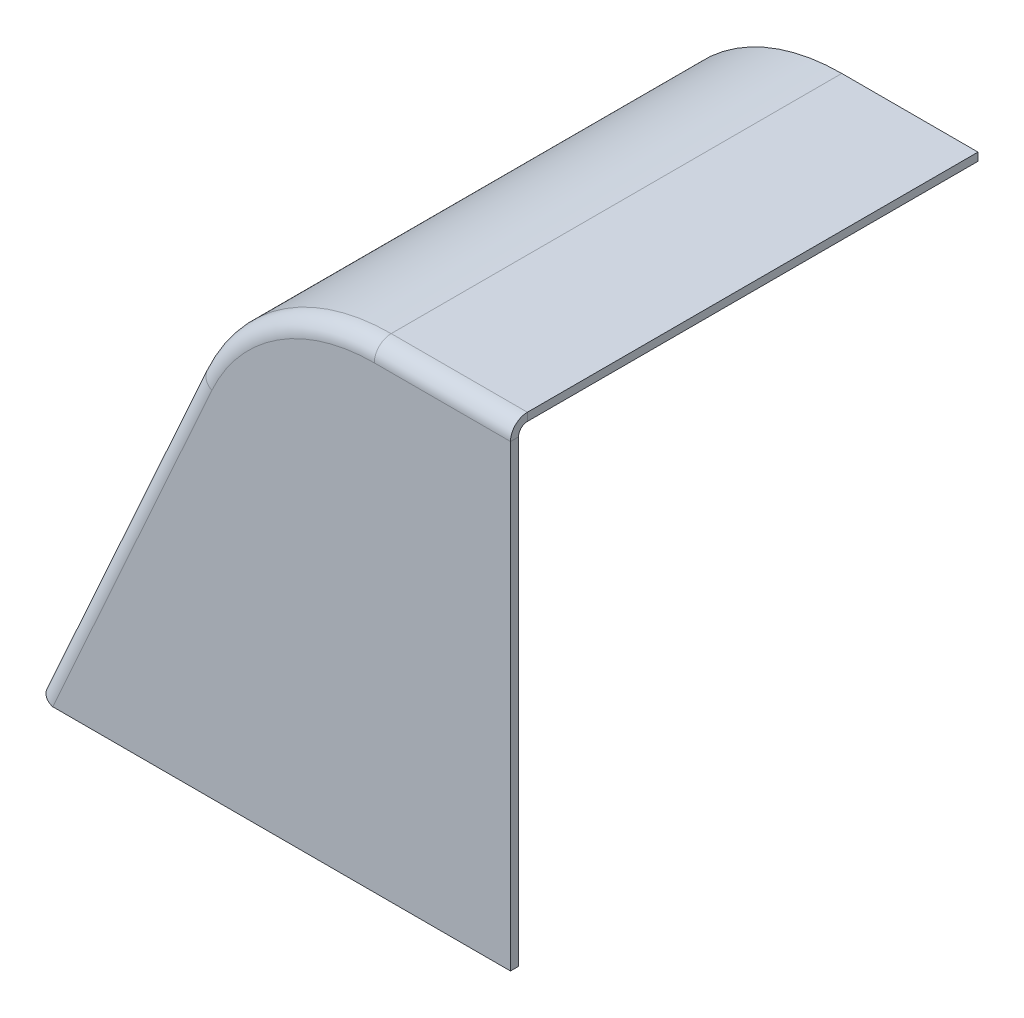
ISO-10303-21;
HEADER;
FILE_DESCRIPTION(('STEP AP214'),'2;1');
FILE_NAME('part.step','',(''),(''),'','','');
FILE_SCHEMA(('AUTOMOTIVE_DESIGN { 1 0 10303 214 1 1 1 1 }'));
ENDSEC;
DATA;
#1=APPLICATION_CONTEXT('core data for automotive mechanical design processes');
#2=APPLICATION_PROTOCOL_DEFINITION('international standard','automotive_design',2000,#1);
#3=PRODUCT_CONTEXT('',#1,'mechanical');
#4=PRODUCT('Part','Part','',(#3));
#5=PRODUCT_RELATED_PRODUCT_CATEGORY('part','',(#4));
#6=PRODUCT_DEFINITION_FORMATION('','',#4);
#7=PRODUCT_DEFINITION_CONTEXT('part definition',#1,'design');
#8=PRODUCT_DEFINITION('design','',#6,#7);
#9=PRODUCT_DEFINITION_SHAPE('','',#8);
#10=(LENGTH_UNIT() NAMED_UNIT(*) SI_UNIT(.MILLI.,.METRE.));
#11=(NAMED_UNIT(*) PLANE_ANGLE_UNIT() SI_UNIT($,.RADIAN.));
#12=(NAMED_UNIT(*) SI_UNIT($,.STERADIAN.) SOLID_ANGLE_UNIT());
#13=UNCERTAINTY_MEASURE_WITH_UNIT(LENGTH_MEASURE(1.E-05),#10,'distance_accuracy_value','');
#14=(GEOMETRIC_REPRESENTATION_CONTEXT(3) GLOBAL_UNCERTAINTY_ASSIGNED_CONTEXT((#13)) GLOBAL_UNIT_ASSIGNED_CONTEXT((#10,
#11,#12)) REPRESENTATION_CONTEXT('',''));
#15=CARTESIAN_POINT('',(0.,0.,0.));
#16=DIRECTION('',(0.,0.,1.));
#17=DIRECTION('',(1.,0.,0.));
#18=AXIS2_PLACEMENT_3D('',#15,#16,#17);
#19=CARTESIAN_POINT('',(0.,0.,-1.70942));
#20=DIRECTION('',(1.,0.,0.));
#21=DIRECTION('',(0.,0.,-1.));
#22=AXIS2_PLACEMENT_3D('',#19,#20,#21);
#23=PLANE('',#22);
#24=DIRECTION('',(0.,0.,1.));
#25=VECTOR('',#24,1.);
#26=CARTESIAN_POINT('',(0.,98.0950000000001,-1.70942));
#27=LINE('',#26,#25);
#28=CARTESIAN_POINT('',(0.,98.0950000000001,-1.70942));
#29=VERTEX_POINT('',#28);
#30=CARTESIAN_POINT('',(0.,98.0950000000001,0.));
#31=VERTEX_POINT('',#30);
#32=EDGE_CURVE('E498',#29,#31,#27,.T.);
#33=ORIENTED_EDGE('',*,*,#32,.T.);
#34=DIRECTION('',(0.,1.,0.));
#35=VECTOR('',#34,1.);
#36=CARTESIAN_POINT('',(0.,0.,0.));
#37=LINE('',#36,#35);
#38=CARTESIAN_POINT('',(0.,0.,0.));
#39=VERTEX_POINT('',#38);
#40=EDGE_CURVE('E513',#39,#31,#37,.T.);
#41=ORIENTED_EDGE('',*,*,#40,.F.);
#42=DIRECTION('',(0.,0.,1.));
#43=VECTOR('',#42,1.);
#44=CARTESIAN_POINT('',(0.,0.,-1.70942));
#45=LINE('',#44,#43);
#46=CARTESIAN_POINT('',(0.,0.,-1.70942));
#47=VERTEX_POINT('',#46);
#48=EDGE_CURVE('E13',#47,#39,#45,.T.);
#49=ORIENTED_EDGE('',*,*,#48,.F.);
#50=DIRECTION('',(0.,1.,0.));
#51=VECTOR('',#50,1.);
#52=CARTESIAN_POINT('',(0.,0.,-1.70942));
#53=LINE('',#52,#51);
#54=EDGE_CURVE('E225',#47,#29,#53,.T.);
#55=ORIENTED_EDGE('',*,*,#54,.T.);
#56=EDGE_LOOP('',(#33,#41,#49,#55));
#57=FACE_BOUND('',#56,.T.);
#58=ADVANCED_FACE('F214',(#57),#23,.T.);
#59=CARTESIAN_POINT('',(-29.1365756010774,60.,-1.70942));
#60=DIRECTION('',(0.,0.,-1.));
#61=DIRECTION('',(-1.,0.,0.));
#62=AXIS2_PLACEMENT_3D('',#59,#60,#61);
#63=PLANE('',#62);
#64=CARTESIAN_POINT('',(-29.1365756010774,60.,-1.70942));
#65=DIRECTION('',(0.,0.,1.));
#66=DIRECTION('',(0.,1.,0.));
#67=AXIS2_PLACEMENT_3D('',#64,#65,#66);
#68=CIRCLE('',#67,38.095);
#69=CARTESIAN_POINT('',(-29.1365756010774,98.095,-1.70942));
#70=VERTEX_POINT('',#69);
#71=CARTESIAN_POINT('',(-63.8762253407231,75.6328423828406,-1.70942));
#72=VERTEX_POINT('',#71);
#73=EDGE_CURVE('E233',#70,#72,#68,.T.);
#74=ORIENTED_EDGE('',*,*,#73,.F.);
#75=DIRECTION('',(-1.,0.,0.));
#76=VECTOR('',#75,1.);
#77=CARTESIAN_POINT('',(0.,98.0950000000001,-1.70942));
#78=LINE('',#77,#76);
#79=EDGE_CURVE('E537',#29,#70,#78,.T.);
#80=ORIENTED_EDGE('',*,*,#79,.F.);
#81=ORIENTED_EDGE('',*,*,#54,.F.);
#82=DIRECTION('',(1.,0.,0.));
#83=VECTOR('',#82,1.);
#84=CARTESIAN_POINT('',(-100.,0.,-1.70942));
#85=LINE('',#84,#83);
#86=CARTESIAN_POINT('',(-97.9110044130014,0.,-1.70942));
#87=VERTEX_POINT('',#86);
#88=EDGE_CURVE('E512',#87,#47,#85,.T.);
#89=ORIENTED_EDGE('',*,*,#88,.F.);
#90=DIRECTION('',(-0.410364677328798,-0.911921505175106,0.));
#91=VECTOR('',#90,1.);
#92=CARTESIAN_POINT('',(-63.8762253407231,75.6328423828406,-1.70942));
#93=LINE('',#92,#91);
#94=EDGE_CURVE('E238',#72,#87,#93,.T.);
#95=ORIENTED_EDGE('',*,*,#94,.F.);
#96=EDGE_LOOP('',(#74,#80,#81,#89,#95));
#97=FACE_BOUND('',#96,.T.);
#98=ADVANCED_FACE('F535',(#97),#63,.T.);
#99=CARTESIAN_POINT('',(-29.1365756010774,60.,0.));
#100=DIRECTION('',(0.,0.,-1.));
#101=DIRECTION('',(-1.,0.,0.));
#102=AXIS2_PLACEMENT_3D('',#99,#100,#101);
#103=PLANE('',#102);
#104=DIRECTION('',(-1.,0.,0.));
#105=VECTOR('',#104,1.);
#106=CARTESIAN_POINT('',(0.,98.0950000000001,0.));
#107=LINE('',#106,#105);
#108=CARTESIAN_POINT('',(-29.1365756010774,98.0950000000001,0.));
#109=VERTEX_POINT('',#108);
#110=EDGE_CURVE('E359',#31,#109,#107,.T.);
#111=ORIENTED_EDGE('',*,*,#110,.T.);
#112=CARTESIAN_POINT('',(-29.1365756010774,60.,0.));
#113=DIRECTION('',(0.,0.,1.));
#114=DIRECTION('',(1.,0.,0.));
#115=AXIS2_PLACEMENT_3D('',#112,#113,#114);
#116=CIRCLE('',#115,38.0950000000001);
#117=CARTESIAN_POINT('',(-63.8762253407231,75.6328423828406,0.));
#118=VERTEX_POINT('',#117);
#119=EDGE_CURVE('E350',#109,#118,#116,.T.);
#120=ORIENTED_EDGE('',*,*,#119,.T.);
#121=DIRECTION('',(-0.410364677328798,-0.911921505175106,0.));
#122=VECTOR('',#121,1.);
#123=CARTESIAN_POINT('',(-63.8762253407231,75.6328423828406,0.));
#124=LINE('',#123,#122);
#125=CARTESIAN_POINT('',(-97.9110044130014,0.,0.));
#126=VERTEX_POINT('',#125);
#127=EDGE_CURVE('E326',#118,#126,#124,.T.);
#128=ORIENTED_EDGE('',*,*,#127,.T.);
#129=DIRECTION('',(1.,0.,0.));
#130=VECTOR('',#129,1.);
#131=CARTESIAN_POINT('',(-100.,0.,0.));
#132=LINE('',#131,#130);
#133=EDGE_CURVE('E501',#126,#39,#132,.T.);
#134=ORIENTED_EDGE('',*,*,#133,.T.);
#135=ORIENTED_EDGE('',*,*,#40,.T.);
#136=EDGE_LOOP('',(#111,#120,#128,#134,#135));
#137=FACE_BOUND('',#136,.T.);
#138=ADVANCED_FACE('F594',(#137),#103,.F.);
#139=CARTESIAN_POINT('',(-100.,0.,-1.70942));
#140=DIRECTION('',(0.,-1.,0.));
#141=DIRECTION('',(0.,0.,-1.));
#142=AXIS2_PLACEMENT_3D('',#139,#140,#141);
#143=PLANE('',#142);
#144=CARTESIAN_POINT('',(-97.9110044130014,0.,-1.70942));
#145=CARTESIAN_POINT('',(-97.9110044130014,0.,0.));
#146=B_SPLINE_CURVE_WITH_KNOTS('',1,(#144,#145),.UNSPECIFIED.,.F.,.F.,(2,2),(0.,1.),.UNSPECIFIED.);
#147=EDGE_CURVE('E502',#87,#126,#146,.T.);
#148=ORIENTED_EDGE('',*,*,#147,.F.);
#149=ORIENTED_EDGE('',*,*,#88,.T.);
#150=ORIENTED_EDGE('',*,*,#48,.T.);
#151=ORIENTED_EDGE('',*,*,#133,.F.);
#152=EDGE_LOOP('',(#148,#149,#150,#151));
#153=FACE_BOUND('',#152,.T.);
#154=ADVANCED_FACE('F216',(#153),#143,.T.);
#155=CARTESIAN_POINT('',(0.,98.095,-3.61442));
#156=DIRECTION('',(-1.,0.,0.));
#157=DIRECTION('',(0.,-1.,0.));
#158=AXIS2_PLACEMENT_3D('',#155,#156,#157);
#159=PLANE('',#158);
#160=ORIENTED_EDGE('',*,*,#32,.F.);
#161=CARTESIAN_POINT('',(0.,98.095,-3.61442));
#162=DIRECTION('',(1.,0.,0.));
#163=DIRECTION('',(0.,1.,0.));
#164=AXIS2_PLACEMENT_3D('',#161,#162,#163);
#165=CIRCLE('',#164,1.905);
#166=CARTESIAN_POINT('',(0.,100.,-3.61442));
#167=VERTEX_POINT('',#166);
#168=EDGE_CURVE('E548',#29,#167,#165,.F.);
#169=ORIENTED_EDGE('',*,*,#168,.T.);
#170=DIRECTION('',(0.,1.,0.));
#171=VECTOR('',#170,1.);
#172=CARTESIAN_POINT('',(0.,100.,-3.61442));
#173=LINE('',#172,#171);
#174=CARTESIAN_POINT('',(0.,101.70942,-3.61442));
#175=VERTEX_POINT('',#174);
#176=EDGE_CURVE('E496',#167,#175,#173,.T.);
#177=ORIENTED_EDGE('',*,*,#176,.T.);
#178=CARTESIAN_POINT('',(0.,98.095,-3.61442));
#179=DIRECTION('',(-1.,0.,0.));
#180=DIRECTION('',(0.,0.,1.));
#181=AXIS2_PLACEMENT_3D('',#178,#179,#180);
#182=CIRCLE('',#181,3.61442);
#183=EDGE_CURVE('E550',#31,#175,#182,.T.);
#184=ORIENTED_EDGE('',*,*,#183,.F.);
#185=EDGE_LOOP('',(#160,#169,#177,#184));
#186=FACE_BOUND('',#185,.T.);
#187=ADVANCED_FACE('F547',(#186),#159,.F.);
#188=CARTESIAN_POINT('',(0.,100.,-1.70942));
#189=DIRECTION('',(1.,0.,0.));
#190=DIRECTION('',(0.,0.,-1.));
#191=AXIS2_PLACEMENT_3D('',#188,#189,#190);
#192=PLANE('',#191);
#193=ORIENTED_EDGE('',*,*,#176,.F.);
#194=DIRECTION('',(0.,0.,-1.));
#195=VECTOR('',#194,1.);
#196=CARTESIAN_POINT('',(0.,100.,-1.70942));
#197=LINE('',#196,#195);
#198=CARTESIAN_POINT('',(0.,100.,-100.));
#199=VERTEX_POINT('',#198);
#200=EDGE_CURVE('E542',#167,#199,#197,.T.);
#201=ORIENTED_EDGE('',*,*,#200,.T.);
#202=DIRECTION('',(0.,1.,0.));
#203=VECTOR('',#202,1.);
#204=CARTESIAN_POINT('',(0.,100.,-100.));
#205=LINE('',#204,#203);
#206=CARTESIAN_POINT('',(0.,101.70942,-100.));
#207=VERTEX_POINT('',#206);
#208=EDGE_CURVE('E494',#199,#207,#205,.T.);
#209=ORIENTED_EDGE('',*,*,#208,.T.);
#210=DIRECTION('',(0.,0.,1.));
#211=VECTOR('',#210,1.);
#212=CARTESIAN_POINT('',(0.,101.70942,-1.70942));
#213=LINE('',#212,#211);
#214=EDGE_CURVE('E591',#175,#207,#213,.F.);
#215=ORIENTED_EDGE('',*,*,#214,.F.);
#216=EDGE_LOOP('',(#193,#201,#209,#215));
#217=FACE_BOUND('',#216,.T.);
#218=ADVANCED_FACE('F616',(#217),#192,.T.);
#219=CARTESIAN_POINT('',(0.,100.,-100.));
#220=DIRECTION('',(0.,0.,-1.));
#221=DIRECTION('',(-1.,0.,0.));
#222=AXIS2_PLACEMENT_3D('',#219,#220,#221);
#223=PLANE('',#222);
#224=ORIENTED_EDGE('',*,*,#208,.F.);
#225=DIRECTION('',(-1.,0.,0.));
#226=VECTOR('',#225,1.);
#227=CARTESIAN_POINT('',(0.,100.,-100.));
#228=LINE('',#227,#226);
#229=CARTESIAN_POINT('',(-29.1365756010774,100.,-100.));
#230=VERTEX_POINT('',#229);
#231=EDGE_CURVE('E569',#199,#230,#228,.T.);
#232=ORIENTED_EDGE('',*,*,#231,.T.);
#233=DIRECTION('',(0.,1.,0.));
#234=VECTOR('',#233,1.);
#235=CARTESIAN_POINT('',(-29.1365756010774,100.,-100.));
#236=LINE('',#235,#234);
#237=CARTESIAN_POINT('',(-29.1365756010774,101.70942,-100.));
#238=VERTEX_POINT('',#237);
#239=EDGE_CURVE('E492',#230,#238,#236,.T.);
#240=ORIENTED_EDGE('',*,*,#239,.T.);
#241=DIRECTION('',(1.,0.,0.));
#242=VECTOR('',#241,1.);
#243=CARTESIAN_POINT('',(0.,101.70942,-100.));
#244=LINE('',#243,#242);
#245=EDGE_CURVE('E352',#207,#238,#244,.F.);
#246=ORIENTED_EDGE('',*,*,#245,.F.);
#247=EDGE_LOOP('',(#224,#232,#240,#246));
#248=FACE_BOUND('',#247,.T.);
#249=ADVANCED_FACE('F617',(#248),#223,.T.);
#250=CARTESIAN_POINT('',(-29.1365756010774,60.,-100.));
#251=DIRECTION('',(0.,0.,-1.));
#252=DIRECTION('',(-1.,0.,0.));
#253=AXIS2_PLACEMENT_3D('',#250,#251,#252);
#254=PLANE('',#253);
#255=ORIENTED_EDGE('',*,*,#239,.F.);
#256=CARTESIAN_POINT('',(-29.1365756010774,60.,-100.));
#257=DIRECTION('',(0.,0.,1.));
#258=DIRECTION('',(0.,1.,0.));
#259=AXIS2_PLACEMENT_3D('',#256,#257,#258);
#260=CIRCLE('',#259,40.);
#261=CARTESIAN_POINT('',(-65.6134358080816,76.4145870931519,-100.));
#262=VERTEX_POINT('',#261);
#263=EDGE_CURVE('E437',#230,#262,#260,.T.);
#264=ORIENTED_EDGE('',*,*,#263,.T.);
#265=DIRECTION('',(-0.911921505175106,0.410364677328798,0.));
#266=VECTOR('',#265,1.);
#267=CARTESIAN_POINT('',(-65.6134358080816,76.4145870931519,-100.));
#268=LINE('',#267,#266);
#269=CARTESIAN_POINT('',(-67.1722926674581,77.1160726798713,-100.));
#270=VERTEX_POINT('',#269);
#271=EDGE_CURVE('E489',#262,#270,#268,.T.);
#272=ORIENTED_EDGE('',*,*,#271,.T.);
#273=CARTESIAN_POINT('',(-29.1365756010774,60.,-100.));
#274=DIRECTION('',(0.,0.,1.));
#275=DIRECTION('',(1.,0.,0.));
#276=AXIS2_PLACEMENT_3D('',#273,#274,#275);
#277=CIRCLE('',#276,41.70942);
#278=EDGE_CURVE('E336',#238,#270,#277,.T.);
#279=ORIENTED_EDGE('',*,*,#278,.F.);
#280=EDGE_LOOP('',(#255,#264,#272,#279));
#281=FACE_BOUND('',#280,.T.);
#282=ADVANCED_FACE('F600',(#281),#254,.T.);
#283=CARTESIAN_POINT('',(-65.6134358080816,76.4145870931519,-100.));
#284=DIRECTION('',(0.,0.,-1.));
#285=DIRECTION('',(-0.410364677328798,-0.911921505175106,0.));
#286=AXIS2_PLACEMENT_3D('',#283,#284,#285);
#287=PLANE('',#286);
#288=ORIENTED_EDGE('',*,*,#271,.F.);
#289=DIRECTION('',(-0.410364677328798,-0.911921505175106,0.));
#290=VECTOR('',#289,1.);
#291=CARTESIAN_POINT('',(-65.6134358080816,76.4145870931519,-100.));
#292=LINE('',#291,#290);
#293=CARTESIAN_POINT('',(-100.,0.,-100.));
#294=VERTEX_POINT('',#293);
#295=EDGE_CURVE('E433',#262,#294,#292,.T.);
#296=ORIENTED_EDGE('',*,*,#295,.T.);
#297=DIRECTION('',(-0.911921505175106,0.410364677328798,0.));
#298=VECTOR('',#297,1.);
#299=CARTESIAN_POINT('',(-100.,0.,-100.));
#300=LINE('',#299,#298);
#301=CARTESIAN_POINT('',(-101.558856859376,0.701485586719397,-100.));
#302=VERTEX_POINT('',#301);
#303=EDGE_CURVE('E482',#294,#302,#300,.T.);
#304=ORIENTED_EDGE('',*,*,#303,.T.);
#305=DIRECTION('',(-0.410364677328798,-0.911921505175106,0.));
#306=VECTOR('',#305,1.);
#307=CARTESIAN_POINT('',(-67.1722926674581,77.1160726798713,-100.));
#308=LINE('',#307,#306);
#309=EDGE_CURVE('E366',#270,#302,#308,.T.);
#310=ORIENTED_EDGE('',*,*,#309,.F.);
#311=EDGE_LOOP('',(#288,#296,#304,#310));
#312=FACE_BOUND('',#311,.T.);
#313=ADVANCED_FACE('F603',(#312),#287,.T.);
#314=CARTESIAN_POINT('',(-100.,0.,-1.70942));
#315=DIRECTION('',(0.410364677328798,0.911921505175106,0.));
#316=DIRECTION('',(0.,0.,-1.));
#317=AXIS2_PLACEMENT_3D('',#314,#315,#316);
#318=PLANE('',#317);
#319=ORIENTED_EDGE('',*,*,#303,.F.);
#320=DIRECTION('',(0.,0.,-1.));
#321=VECTOR('',#320,1.);
#322=CARTESIAN_POINT('',(-100.,0.,-1.70942));
#323=LINE('',#322,#321);
#324=CARTESIAN_POINT('',(-100.,0.,-3.61442));
#325=VERTEX_POINT('',#324);
#326=EDGE_CURVE('E428',#325,#294,#323,.T.);
#327=ORIENTED_EDGE('',*,*,#326,.F.);
#328=CARTESIAN_POINT('',(-101.558856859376,0.701485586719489,-3.61442));
#329=CARTESIAN_POINT('',(-100.,0.,-3.61442));
#330=B_SPLINE_CURVE_WITH_KNOTS('',1,(#328,#329),.UNSPECIFIED.,.F.,.F.,(2,2),(0.,1.),.UNSPECIFIED.);
#331=CARTESIAN_POINT('',(-101.558856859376,0.701485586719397,-3.61442));
#332=VERTEX_POINT('',#331);
#333=EDGE_CURVE('E490',#325,#332,#330,.F.);
#334=ORIENTED_EDGE('',*,*,#333,.T.);
#335=DIRECTION('',(0.,0.,1.));
#336=VECTOR('',#335,1.);
#337=CARTESIAN_POINT('',(-101.558856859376,0.701485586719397,-1.70942));
#338=LINE('',#337,#336);
#339=EDGE_CURVE('E321',#332,#302,#338,.F.);
#340=ORIENTED_EDGE('',*,*,#339,.T.);
#341=EDGE_LOOP('',(#319,#327,#334,#340));
#342=FACE_BOUND('',#341,.T.);
#343=ADVANCED_FACE('F461',(#342),#318,.F.);
#344=CARTESIAN_POINT('',(-101.558856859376,0.701485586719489,-3.61442));
#345=CARTESIAN_POINT('',(-101.546862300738,0.728140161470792,-3.41036892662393));
#346=CARTESIAN_POINT('',(-101.517806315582,0.750702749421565,-3.18750892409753));
#347=CARTESIAN_POINT('',(-101.435374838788,0.772361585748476,-2.83258333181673));
#348=CARTESIAN_POINT('',(-101.401409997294,0.777549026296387,-2.71086416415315));
#349=CARTESIAN_POINT('',(-101.339057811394,0.781528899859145,-2.52464746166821));
#350=CARTESIAN_POINT('',(-101.316373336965,0.782222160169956,-2.46197345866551));
#351=CARTESIAN_POINT('',(-101.279294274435,0.782221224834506,-2.36728749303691));
#352=CARTESIAN_POINT('',(-101.266425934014,0.782047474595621,-2.33561331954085));
#353=CARTESIAN_POINT('',(-101.246336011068,0.781515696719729,-2.28796506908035));
#354=CARTESIAN_POINT('',(-101.239508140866,0.781293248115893,-2.27205950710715));
#355=CARTESIAN_POINT('',(-101.229066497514,0.780890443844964,-2.24817103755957));
#356=CARTESIAN_POINT('',(-101.225552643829,0.780744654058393,-2.24020319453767));
#357=CARTESIAN_POINT('',(-101.220231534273,0.780508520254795,-2.22824442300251));
#358=CARTESIAN_POINT('',(-101.218449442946,0.780426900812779,-2.22425699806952));
#359=CARTESIAN_POINT('',(-101.215763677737,0.780300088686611,-2.21827417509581));
#360=CARTESIAN_POINT('',(-101.214866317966,0.780257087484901,-2.21627961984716));
#361=CARTESIAN_POINT('',(-101.213067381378,0.780169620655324,-2.21228995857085));
#362=CARTESIAN_POINT('',(-101.211746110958,0.780104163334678,-2.20936815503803));
#363=CARTESIAN_POINT('',(-101.14931068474,0.776981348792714,-2.0715086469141));
#364=CARTESIAN_POINT('',(-101.062471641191,0.769877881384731,-1.89887646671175));
#365=CARTESIAN_POINT('',(-100.808831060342,0.734076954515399,-1.50446334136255));
#366=CARTESIAN_POINT('',(-100.641576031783,0.705181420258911,-1.28230674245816));
#367=CARTESIAN_POINT('',(-100.193561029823,0.610678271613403,-0.834971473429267));
#368=CARTESIAN_POINT('',(-99.9736621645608,0.558084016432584,-0.670621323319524));
#369=CARTESIAN_POINT('',(-99.6819227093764,0.485554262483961,-0.486123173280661));
#370=CARTESIAN_POINT('',(-99.5908110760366,0.46234046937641,-0.434913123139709));
#371=CARTESIAN_POINT('',(-99.4656861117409,0.430017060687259,-0.370226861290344));
#372=CARTESIAN_POINT('',(-99.4258917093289,0.419654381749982,-0.35068928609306));
#373=CARTESIAN_POINT('',(-99.3692848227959,0.4048242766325,-0.324043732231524));
#374=CARTESIAN_POINT('',(-99.3509294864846,0.399999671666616,-0.315605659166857));
#375=CARTESIAN_POINT('',(-99.3241894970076,0.392951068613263,-0.303570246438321));
#376=CARTESIAN_POINT('',(-99.3154083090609,0.390632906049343,-0.299662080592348));
#377=CARTESIAN_POINT('',(-99.3024373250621,0.387203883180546,-0.293949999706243));
#378=CARTESIAN_POINT('',(-99.2981471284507,0.386068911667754,-0.292071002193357));
#379=CARTESIAN_POINT('',(-99.2917623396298,0.384378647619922,-0.289289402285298));
#380=CARTESIAN_POINT('',(-99.2896424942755,0.383817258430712,-0.28836835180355));
#381=CARTESIAN_POINT('',(-99.286475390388,0.382978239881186,-0.286995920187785));
#382=CARTESIAN_POINT('',(-99.2854217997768,0.382699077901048,-0.286539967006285));
#383=CARTESIAN_POINT('',(-99.2833188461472,0.382141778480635,-0.285631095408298));
#384=CARTESIAN_POINT('',(-99.2831770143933,0.382104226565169,-0.285569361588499));
#385=CARTESIAN_POINT('',(-98.7807992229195,0.248924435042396,-0.0690231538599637));
#386=CARTESIAN_POINT('',(-98.305323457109,0.113634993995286,0.));
#387=CARTESIAN_POINT('',(-97.9110044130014,0.,0.));
#388=CARTESIAN_POINT('',(-100.,0.,-3.61442));
#389=CARTESIAN_POINT('',(-99.9880051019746,0.0266553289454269,-3.50687071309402));
#390=CARTESIAN_POINT('',(-99.9663839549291,0.0525626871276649,-3.3894141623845));
#391=CARTESIAN_POINT('',(-99.9125395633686,0.0870857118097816,-3.20234867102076));
#392=CARTESIAN_POINT('',(-99.8910150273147,0.0978712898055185,-3.13819591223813));
#393=CARTESIAN_POINT('',(-99.8524816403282,0.112569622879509,-3.04004937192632));
#394=CARTESIAN_POINT('',(-99.8385962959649,0.117222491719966,-3.00701669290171));
#395=CARTESIAN_POINT('',(-99.8161006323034,0.123784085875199,-2.95711193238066));
#396=CARTESIAN_POINT('',(-99.8083241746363,0.125901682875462,-2.94041788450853));
#397=CARTESIAN_POINT('',(-99.7962297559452,0.128967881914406,-2.91530461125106));
#398=CARTESIAN_POINT('',(-99.7921266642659,0.129971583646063,-2.90692149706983));
#399=CARTESIAN_POINT('',(-99.7858630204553,0.131448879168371,-2.89433094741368));
#400=CARTESIAN_POINT('',(-99.7837569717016,0.131936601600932,-2.89013145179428));
#401=CARTESIAN_POINT('',(-99.7805704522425,0.132661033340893,-2.88382851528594));
#402=CARTESIAN_POINT('',(-99.7795037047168,0.13290131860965,-2.88172692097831));
#403=CARTESIAN_POINT('',(-99.7778966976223,0.133259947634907,-2.87857364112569));
#404=CARTESIAN_POINT('',(-99.7773598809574,0.133379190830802,-2.8775223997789));
#405=CARTESIAN_POINT('',(-99.776283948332,0.13361707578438,-2.87541962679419));
#406=CARTESIAN_POINT('',(-99.7754939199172,0.133790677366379,-2.87387967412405));
#407=CARTESIAN_POINT('',(-99.7381671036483,0.141966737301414,-2.80122005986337));
#408=CARTESIAN_POINT('',(-99.6867391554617,0.150798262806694,-2.71023331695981));
#409=CARTESIAN_POINT('',(-99.5391919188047,0.162739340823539,-2.50235570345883));
#410=CARTESIAN_POINT('',(-99.4428325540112,0.165746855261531,-2.38526684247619));
#411=CARTESIAN_POINT('',(-99.1877479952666,0.158062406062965,-2.14949632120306));
#412=CARTESIAN_POINT('',(-99.0636439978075,0.148575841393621,-2.06287466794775));
#413=CARTESIAN_POINT('',(-98.8994826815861,0.133456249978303,-1.96563390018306));
#414=CARTESIAN_POINT('',(-98.8483138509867,0.128216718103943,-1.93864336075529));
#415=CARTESIAN_POINT('',(-98.7781214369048,0.120612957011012,-1.90455010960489));
#416=CARTESIAN_POINT('',(-98.7558122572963,0.118118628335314,-1.89425272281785));
#417=CARTESIAN_POINT('',(-98.724093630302,0.114488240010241,-1.88020903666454));
#418=CARTESIAN_POINT('',(-98.7138113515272,0.11329651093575,-1.87576170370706));
#419=CARTESIAN_POINT('',(-98.6988357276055,0.111541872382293,-1.86941837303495));
#420=CARTESIAN_POINT('',(-98.6939184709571,0.11096247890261,-1.86735855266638));
#421=CARTESIAN_POINT('',(-98.6866558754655,0.110102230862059,-1.86434796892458));
#422=CARTESIAN_POINT('',(-98.6842538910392,0.109816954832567,-1.8633576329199));
#423=CARTESIAN_POINT('',(-98.6806793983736,0.109391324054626,-1.86189157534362));
#424=CARTESIAN_POINT('',(-98.6794926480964,0.109249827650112,-1.86140613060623));
#425=CARTESIAN_POINT('',(-98.6777196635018,0.109038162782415,-1.8606827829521));
#426=CARTESIAN_POINT('',(-98.6771298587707,0.108967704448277,-1.86044247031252));
#427=CARTESIAN_POINT('',(-98.6759526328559,0.108826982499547,-1.859963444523));
#428=CARTESIAN_POINT('',(-98.6758732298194,0.108817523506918,-1.85993090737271));
#429=CARTESIAN_POINT('',(-98.3946520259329,0.0751581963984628,-1.74579903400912));
#430=CARTESIAN_POINT('',(-98.1301831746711,0.0348051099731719,-1.70942));
#431=CARTESIAN_POINT('',(-97.9110044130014,0.,-1.70942));
#432=B_SPLINE_SURFACE_WITH_KNOTS('',1,3,((#344,#345,#346,#347,#348,#349,#350,#351,#352,#353,
#354,#355,#356,#357,#358,#359,#360,#361,#362,#363,#364,#365,#366,#367,#368,#369,#370,#371,#372,
#373,#374,#375,#376,#377,#378,#379,#380,#381,#382,#383,#384,#385,#386,#387),(#388,#389,#390,
#391,#392,#393,#394,#395,#396,#397,#398,#399,#400,#401,#402,#403,#404,#405,#406,#407,#408,#409,
#410,#411,#412,#413,#414,#415,#416,#417,#418,#419,#420,#421,#422,#423,#424,#425,#426,#427,#428,
#429,#430,#431)),.UNSPECIFIED.,.F.,.F.,.F.,(2,2),(4,2,2,2,2,2,2,2,2,2,2,2,2,2,2,2,2,2,2,2,2,4),
(0.,1.),(0.,0.125,0.1875,0.21875,0.234375,0.2421875,0.24609375,0.248046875,0.2490234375,0.25,
0.375,0.5,0.625,0.6875,0.71875,0.734375,0.7421875,0.74609375,0.748046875,0.7490234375,0.75,1.),.UNSPECIFIED.);
#433=CARTESIAN_POINT('',(-100.,0.,-3.61442));
#434=CARTESIAN_POINT('',(-99.996931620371,0.00681947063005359,-3.58690656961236));
#435=CARTESIAN_POINT('',(-99.9933038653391,0.0134278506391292,-3.55940323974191));
#436=CARTESIAN_POINT('',(-99.9847514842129,0.0265015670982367,-3.50324478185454));
#437=CARTESIAN_POINT('',(-99.9797763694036,0.0329474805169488,-3.4745928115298));
#438=CARTESIAN_POINT('',(-99.9683858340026,0.0456315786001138,-3.4162038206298));
#439=CARTESIAN_POINT('',(-99.9619181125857,0.0518492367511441,-3.38647253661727));
#440=CARTESIAN_POINT('',(-99.9473967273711,0.0640116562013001,-3.32600706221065));
#441=CARTESIAN_POINT('',(-99.9392890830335,0.0699349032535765,-3.29528149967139));
#442=CARTESIAN_POINT('',(-99.9213409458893,0.0814426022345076,-3.23292632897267));
#443=CARTESIAN_POINT('',(-99.9114449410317,0.087004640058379,-3.20130855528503));
#444=CARTESIAN_POINT('',(-99.8897734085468,0.0977240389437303,-3.13728555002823));
#445=CARTESIAN_POINT('',(-99.8779410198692,0.102858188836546,-3.10489566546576));
#446=CARTESIAN_POINT('',(-99.8522521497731,0.112657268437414,-3.03946492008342));
#447=CARTESIAN_POINT('',(-99.8383376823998,0.11729832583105,-3.0064432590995));
#448=CARTESIAN_POINT('',(-99.808343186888,0.126046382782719,-2.93990239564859));
#449=CARTESIAN_POINT('',(-99.7922042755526,0.130128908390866,-2.90640643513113));
#450=CARTESIAN_POINT('',(-99.7652890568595,0.136026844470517,-2.85401584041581));
#451=CARTESIAN_POINT('',(-99.7550806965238,0.138078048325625,-2.83485336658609));
#452=CARTESIAN_POINT('',(-99.7326987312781,0.142193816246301,-2.79430699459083));
#453=CARTESIAN_POINT('',(-99.7204437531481,0.14422428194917,-2.77296440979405));
#454=CARTESIAN_POINT('',(-99.6937364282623,0.148193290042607,-2.72821474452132));
#455=CARTESIAN_POINT('',(-99.6791946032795,0.150093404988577,-2.70485764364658));
#456=CARTESIAN_POINT('',(-99.6476626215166,0.153689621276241,-2.65627282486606));
#457=CARTESIAN_POINT('',(-99.63057545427,0.155343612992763,-2.63110489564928));
#458=CARTESIAN_POINT('',(-99.5936885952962,0.158328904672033,-2.57913547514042));
#459=CARTESIAN_POINT('',(-99.5737852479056,0.15961483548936,-2.55240488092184));
#460=CARTESIAN_POINT('',(-99.5309947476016,0.161741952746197,-2.49759642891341));
#461=CARTESIAN_POINT('',(-99.5079984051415,0.162535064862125,-2.46960195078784));
#462=CARTESIAN_POINT('',(-99.4587473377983,0.163554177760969,-2.41260369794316));
#463=CARTESIAN_POINT('',(-99.4323789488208,0.163730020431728,-2.38369691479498));
#464=CARTESIAN_POINT('',(-99.3909389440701,0.163483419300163,-2.34066254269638));
#465=CARTESIAN_POINT('',(-99.3764137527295,0.163304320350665,-2.32600286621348));
#466=CARTESIAN_POINT('',(-99.3464366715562,0.162754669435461,-2.2966013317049));
#467=CARTESIAN_POINT('',(-99.3309701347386,0.162377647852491,-2.28187449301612));
#468=CARTESIAN_POINT('',(-99.2996120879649,0.161431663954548,-2.25289021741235));
#469=CARTESIAN_POINT('',(-99.2837206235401,0.160862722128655,-2.23863273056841));
#470=CARTESIAN_POINT('',(-99.2520696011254,0.159558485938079,-2.21107311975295));
#471=CARTESIAN_POINT('',(-99.2363236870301,0.158829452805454,-2.19775499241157));
#472=CARTESIAN_POINT('',(-99.1901976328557,0.156472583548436,-2.15986666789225));
#473=CARTESIAN_POINT('',(-99.159333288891,0.154624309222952,-2.13589453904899));
#474=CARTESIAN_POINT('',(-99.0986845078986,0.150512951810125,-2.09140188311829));
#475=CARTESIAN_POINT('',(-99.068988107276,0.148290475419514,-2.07075718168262));
#476=CARTESIAN_POINT('',(-99.011007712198,0.143581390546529,-2.03260907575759));
#477=CARTESIAN_POINT('',(-98.9827993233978,0.141129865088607,-2.01498642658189));
#478=CARTESIAN_POINT('',(-98.9280788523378,0.136090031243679,-1.98257280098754));
#479=CARTESIAN_POINT('',(-98.9016309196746,0.133531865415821,-1.96766872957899));
#480=CARTESIAN_POINT('',(-98.8506678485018,0.128384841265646,-1.94038798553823));
#481=CARTESIAN_POINT('',(-98.826206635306,0.125821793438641,-1.92790560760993));
#482=CARTESIAN_POINT('',(-98.7794115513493,0.120752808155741,-1.90517675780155));
#483=CARTESIAN_POINT('',(-98.757122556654,0.118268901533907,-1.89483295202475));
#484=CARTESIAN_POINT('',(-98.7148316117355,0.113427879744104,-1.8761081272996));
#485=CARTESIAN_POINT('',(-98.694866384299,0.111089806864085,-1.86763893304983));
#486=CARTESIAN_POINT('',(-98.6403485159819,0.104567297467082,-1.84551381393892));
#487=CARTESIAN_POINT('',(-98.6055591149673,0.100256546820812,-1.83247235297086));
#488=CARTESIAN_POINT('',(-98.5365575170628,0.0914504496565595,-1.80871050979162));
#489=CARTESIAN_POINT('',(-98.5023657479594,0.0869663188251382,-1.79792641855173));
#490=CARTESIAN_POINT('',(-98.4347072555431,0.0778784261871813,-1.77852166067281));
#491=CARTESIAN_POINT('',(-98.4012572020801,0.0732843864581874,-1.76983834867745));
#492=CARTESIAN_POINT('',(-98.3352135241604,0.0640359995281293,-1.75447431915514));
#493=CARTESIAN_POINT('',(-98.3026330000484,0.0593899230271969,-1.74773225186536));
#494=CARTESIAN_POINT('',(-98.2384411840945,0.0500879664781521,-1.73608689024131));
#495=CARTESIAN_POINT('',(-98.2068397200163,0.0454390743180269,-1.73112380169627));
#496=CARTESIAN_POINT('',(-98.1447020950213,0.0361745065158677,-1.72287193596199));
#497=CARTESIAN_POINT('',(-98.11417276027,0.0315646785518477,-1.7195251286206));
#498=CARTESIAN_POINT('',(-98.0542596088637,0.0224142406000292,-1.71434247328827));
#499=CARTESIAN_POINT('',(-98.0248798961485,0.0178784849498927,-1.71245053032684));
#500=CARTESIAN_POINT('',(-97.9673318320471,0.00890510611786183,-1.71001611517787));
#501=CARTESIAN_POINT('',(-97.93916512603,0.00447151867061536,-1.70941965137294));
#502=CARTESIAN_POINT('',(-97.9110044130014,0.,-1.70942));
#503=B_SPLINE_CURVE_WITH_KNOTS('',3,(#433,#434,#435,#436,#437,#438,#439,#440,#441,#442,#443,
#444,#445,#446,#447,#448,#449,#450,#451,#452,#453,#454,#455,#456,#457,#458,#459,#460,#461,#462,
#463,#464,#465,#466,#467,#468,#469,#470,#471,#472,#473,#474,#475,#476,#477,#478,#479,#480,#481,
#482,#483,#484,#485,#486,#487,#488,#489,#490,#491,#492,#493,#494,#495,#496,#497,#498,#499,#500,
#501,#502),.UNSPECIFIED.,.F.,.F.,(4,2,2,2,2,2,2,2,2,2,2,2,2,2,2,2,2,2,2,2,2,2,2,2,2,2,2,2,2,2,2,
2,2,2,4),(0.,0.085528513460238,0.174859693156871,0.267993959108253,0.364931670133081,
0.465673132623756,0.570218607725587,0.678568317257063,0.790722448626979,0.85613915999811,
0.930205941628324,1.01292250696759,1.10428852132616,1.20430360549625,1.31296733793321,
1.43027925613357,1.49218505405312,1.55625345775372,1.62031502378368,1.68221489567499,
1.79951769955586,1.90817596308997,2.00818922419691,2.09955706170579,2.1822790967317,
2.25635499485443,2.32178446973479,2.43393275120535,2.54227828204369,2.64682124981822,
2.74756187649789,2.84450042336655,2.93763719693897,3.0269725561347,3.11250692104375),.UNSPECIFIED.);
#504=EDGE_CURVE('E219',#325,#87,#503,.T.);
#505=CARTESIAN_POINT('',(-101.558856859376,0.70148558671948,-3.61442));
#506=CARTESIAN_POINT('',(-101.555789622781,0.708303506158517,-3.56223099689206));
#507=CARTESIAN_POINT('',(-101.551674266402,0.714692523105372,-3.51004750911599));
#508=CARTESIAN_POINT('',(-101.541130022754,0.726869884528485,-3.40349630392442));
#509=CARTESIAN_POINT('',(-101.53460737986,0.732619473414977,-3.34913341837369));
#510=CARTESIAN_POINT('',(-101.518976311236,0.743395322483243,-3.23835009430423));
#511=CARTESIAN_POINT('',(-101.509770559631,0.748380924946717,-3.18193941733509));
#512=CARTESIAN_POINT('',(-101.488497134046,0.757504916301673,-3.06721631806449));
#513=CARTESIAN_POINT('',(-101.476328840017,0.761600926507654,-3.00891916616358));
#514=CARTESIAN_POINT('',(-101.448851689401,0.768820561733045,-2.89061066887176));
#515=CARTESIAN_POINT('',(-101.433439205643,0.771900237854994,-2.8306206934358));
#516=CARTESIAN_POINT('',(-101.399195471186,0.776962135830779,-2.70914776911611));
#517=CARTESIAN_POINT('',(-101.380257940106,0.778899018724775,-2.64769286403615));
#518=CARTESIAN_POINT('',(-101.338689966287,0.781552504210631,-2.52354891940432));
#519=CARTESIAN_POINT('',(-101.315951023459,0.782222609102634,-2.46089523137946));
#520=CARTESIAN_POINT('',(-101.266511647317,0.782220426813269,-2.33464526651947));
#521=CARTESIAN_POINT('',(-101.239700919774,0.781500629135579,-2.27109202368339));
#522=CARTESIAN_POINT('',(-101.194678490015,0.779251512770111,-2.17168302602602));
#523=CARTESIAN_POINT('',(-101.177541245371,0.778184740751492,-2.13532524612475));
#524=CARTESIAN_POINT('',(-101.13983952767,0.775406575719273,-2.05839550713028));
#525=CARTESIAN_POINT('',(-101.119121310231,0.773628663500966,-2.01790102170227));
#526=CARTESIAN_POINT('',(-101.073817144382,0.769229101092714,-1.93299593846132));
#527=CARTESIAN_POINT('',(-101.049061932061,0.76653322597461,-1.88867948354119));
#528=CARTESIAN_POINT('',(-100.9952075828,0.760084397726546,-1.79649780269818));
#529=CARTESIAN_POINT('',(-100.965924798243,0.756250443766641,-1.7487453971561));
#530=CARTESIAN_POINT('',(-100.902514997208,0.747300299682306,-1.65014256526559));
#531=CARTESIAN_POINT('',(-100.868191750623,0.74209713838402,-1.59942622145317));
#532=CARTESIAN_POINT('',(-100.794182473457,0.730176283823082,-1.49543425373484));
#533=CARTESIAN_POINT('',(-100.754289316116,0.723366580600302,-1.44231606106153));
#534=CARTESIAN_POINT('',(-100.69127516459,0.712063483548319,-1.36276188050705));
#535=CARTESIAN_POINT('',(-100.669086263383,0.707986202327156,-1.33552199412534));
#536=CARTESIAN_POINT('',(-100.62314864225,0.699354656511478,-1.28067843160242));
#537=CARTESIAN_POINT('',(-100.599372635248,0.694788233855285,-1.25309946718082));
#538=CARTESIAN_POINT('',(-100.550199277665,0.685150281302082,-1.19767891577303));
#539=CARTESIAN_POINT('',(-100.524774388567,0.680066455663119,-1.1698639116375));
#540=CARTESIAN_POINT('',(-100.472242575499,0.6693673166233,-1.11407871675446));
#541=CARTESIAN_POINT('',(-100.445107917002,0.663739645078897,-1.08613700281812));
#542=CARTESIAN_POINT('',(-100.390032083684,0.652120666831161,-1.0311441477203));
#543=CARTESIAN_POINT('',(-100.362090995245,0.646129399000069,-1.0040929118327));
#544=CARTESIAN_POINT('',(-100.306382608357,0.633999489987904,-0.951802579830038));
#545=CARTESIAN_POINT('',(-100.278641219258,0.627872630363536,-0.926533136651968));
#546=CARTESIAN_POINT('',(-100.223433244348,0.615517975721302,-0.877739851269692));
#547=CARTESIAN_POINT('',(-100.195990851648,0.60930116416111,-0.854185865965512));
#548=CARTESIAN_POINT('',(-100.141476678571,0.596809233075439,-0.808755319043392));
#549=CARTESIAN_POINT('',(-100.114427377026,0.590544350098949,-0.786848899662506));
#550=CARTESIAN_POINT('',(-100.035503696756,0.572080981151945,-0.724749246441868));
#551=CARTESIAN_POINT('',(-99.9828975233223,0.559549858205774,-0.685576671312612));
#552=CARTESIAN_POINT('',(-99.8800674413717,0.534658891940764,-0.613195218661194));
#553=CARTESIAN_POINT('',(-99.8299865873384,0.52236461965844,-0.579759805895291));
#554=CARTESIAN_POINT('',(-99.7327405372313,0.498188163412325,-0.518260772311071));
#555=CARTESIAN_POINT('',(-99.6856970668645,0.486362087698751,-0.489982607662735));
#556=CARTESIAN_POINT('',(-99.5949757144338,0.463323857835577,-0.438221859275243));
#557=CARTESIAN_POINT('',(-99.5514000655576,0.452159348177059,-0.414538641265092));
#558=CARTESIAN_POINT('',(-99.4679831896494,0.430610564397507,-0.371414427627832));
#559=CARTESIAN_POINT('',(-99.428227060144,0.420266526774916,-0.351788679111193));
#560=CARTESIAN_POINT('',(-99.3527522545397,0.400492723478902,-0.316261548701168));
#561=CARTESIAN_POINT('',(-99.3171032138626,0.39109695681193,-0.30019271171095));
#562=CARTESIAN_POINT('',(-99.2197061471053,0.365280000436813,-0.25821120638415));
#563=CARTESIAN_POINT('',(-99.1575083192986,0.348635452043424,-0.233467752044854));
#564=CARTESIAN_POINT('',(-99.0340592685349,0.315327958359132,-0.18838371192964));
#565=CARTESIAN_POINT('',(-98.9728464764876,0.298684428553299,-0.167923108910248));
#566=CARTESIAN_POINT('',(-98.8516479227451,0.265503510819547,-0.13110580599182));
#567=CARTESIAN_POINT('',(-98.7916935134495,0.248982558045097,-0.114631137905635));
#568=CARTESIAN_POINT('',(-98.6732609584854,0.216159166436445,-0.0854804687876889));
#569=CARTESIAN_POINT('',(-98.6148074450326,0.199870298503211,-0.0726889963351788));
#570=CARTESIAN_POINT('',(-98.4995906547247,0.167607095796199,-0.0505938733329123));
#571=CARTESIAN_POINT('',(-98.4428458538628,0.151643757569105,-0.041177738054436));
#572=CARTESIAN_POINT('',(-98.3312287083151,0.120113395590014,-0.0255212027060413));
#573=CARTESIAN_POINT('',(-98.2763691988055,0.104555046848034,-0.0191717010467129));
#574=CARTESIAN_POINT('',(-98.1686747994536,0.0739030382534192,-0.00933849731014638));
#575=CARTESIAN_POINT('',(-98.1158476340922,0.0588159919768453,-0.00574940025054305));
#576=CARTESIAN_POINT('',(-98.0123427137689,0.0291620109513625,-0.00113045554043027));
#577=CARTESIAN_POINT('',(-97.9616680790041,0.0145999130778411,7.54513142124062E-07));
#578=CARTESIAN_POINT('',(-97.9110044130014,0.,0.));
#579=B_SPLINE_CURVE_WITH_KNOTS('',3,(#505,#506,#507,#508,#509,#510,#511,#512,#513,#514,#515,
#516,#517,#518,#519,#520,#521,#522,#523,#524,#525,#526,#527,#528,#529,#530,#531,#532,#533,#534,
#535,#536,#537,#538,#539,#540,#541,#542,#543,#544,#545,#546,#547,#548,#549,#550,#551,#552,#553,
#554,#555,#556,#557,#558,#559,#560,#561,#562,#563,#564,#565,#566,#567,#568,#569,#570,#571,#572,
#573,#574,#575,#576,#577,#578),.UNSPECIFIED.,.F.,.F.,(4,2,2,2,2,2,2,2,2,2,2,2,2,2,2,2,2,2,2,2,2,
2,2,2,2,2,2,2,2,2,2,2,2,2,2,2,4),(0.,0.158153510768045,0.323259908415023,0.495319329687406,
0.674331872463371,0.860297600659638,1.05321654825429,1.25308872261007,1.45991410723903,
1.58052096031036,1.7170534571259,1.86951098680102,2.03789285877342,2.22219830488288,
2.42242648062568,2.5285221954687,2.6385995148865,2.75265840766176,2.87069884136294,
2.98872667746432,3.10277465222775,3.2128427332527,3.31893088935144,3.51914898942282,
3.70345107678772,3.87183630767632,4.02430391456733,4.16085320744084,4.28148357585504,
4.4882981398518,4.68816258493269,4.88107689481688,5.06704107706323,5.2460551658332,
5.41811922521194,5.58323335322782,5.74139768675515),.UNSPECIFIED.);
#580=EDGE_CURVE('E443',#332,#126,#579,.T.);
#581=ORIENTED_EDGE('',*,*,#333,.F.);
#582=ORIENTED_EDGE('',*,*,#504,.T.);
#583=ORIENTED_EDGE('',*,*,#147,.T.);
#584=ORIENTED_EDGE('',*,*,#580,.F.);
#585=EDGE_LOOP('',(#581,#582,#583,#584));
#586=FACE_BOUND('',#585,.T.);
#587=ADVANCED_FACE('F378',(#586),#432,.T.);
#588=CARTESIAN_POINT('',(-63.8762253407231,75.6328423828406,-3.61442));
#589=DIRECTION('',(-0.410364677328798,-0.911921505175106,0.));
#590=DIRECTION('',(0.911921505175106,-0.410364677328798,0.));
#591=AXIS2_PLACEMENT_3D('',#588,#589,#590);
#592=CYLINDRICAL_SURFACE('',#591,3.61442);
#593=DIRECTION('',(-0.410364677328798,-0.911921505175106,0.));
#594=VECTOR('',#593,1.);
#595=CARTESIAN_POINT('',(-67.1722926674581,77.1160726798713,-3.61442));
#596=LINE('',#595,#594);
#597=CARTESIAN_POINT('',(-67.1722926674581,77.1160726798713,-3.61442));
#598=VERTEX_POINT('',#597);
#599=EDGE_CURVE('E315',#598,#332,#596,.T.);
#600=ORIENTED_EDGE('',*,*,#599,.T.);
#601=ORIENTED_EDGE('',*,*,#580,.T.);
#602=ORIENTED_EDGE('',*,*,#127,.F.);
#603=CARTESIAN_POINT('',(-63.8762253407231,75.6328423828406,-3.61442));
#604=DIRECTION('',(-0.410364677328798,-0.911921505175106,0.));
#605=DIRECTION('',(0.911921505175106,-0.410364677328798,0.));
#606=AXIS2_PLACEMENT_3D('',#603,#604,#605);
#607=CIRCLE('',#606,3.61442);
#608=EDGE_CURVE('E344',#118,#598,#607,.T.);
#609=ORIENTED_EDGE('',*,*,#608,.T.);
#610=EDGE_LOOP('',(#600,#601,#602,#609));
#611=FACE_BOUND('',#610,.T.);
#612=ADVANCED_FACE('F349',(#611),#592,.T.);
#613=CARTESIAN_POINT('',(-67.1722926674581,77.1160726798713,-1.70942));
#614=DIRECTION('',(-0.911921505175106,0.410364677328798,0.));
#615=DIRECTION('',(-0.410364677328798,-0.911921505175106,0.));
#616=AXIS2_PLACEMENT_3D('',#613,#614,#615);
#617=PLANE('',#616);
#618=ORIENTED_EDGE('',*,*,#309,.T.);
#619=ORIENTED_EDGE('',*,*,#339,.F.);
#620=ORIENTED_EDGE('',*,*,#599,.F.);
#621=DIRECTION('',(0.,0.,1.));
#622=VECTOR('',#621,1.);
#623=CARTESIAN_POINT('',(-67.1722926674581,77.1160726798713,-1.70942));
#624=LINE('',#623,#622);
#625=EDGE_CURVE('E319',#598,#270,#624,.F.);
#626=ORIENTED_EDGE('',*,*,#625,.T.);
#627=EDGE_LOOP('',(#618,#619,#620,#626));
#628=FACE_BOUND('',#627,.T.);
#629=ADVANCED_FACE('F318',(#628),#617,.T.);
#630=CARTESIAN_POINT('',(-29.1365756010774,60.,-1.70942));
#631=DIRECTION('',(0.,0.,1.));
#632=DIRECTION('',(1.,0.,0.));
#633=AXIS2_PLACEMENT_3D('',#630,#631,#632);
#634=CYLINDRICAL_SURFACE('',#633,41.70942);
#635=ORIENTED_EDGE('',*,*,#278,.T.);
#636=ORIENTED_EDGE('',*,*,#625,.F.);
#637=CARTESIAN_POINT('',(-29.1365756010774,60.,-3.61442));
#638=DIRECTION('',(0.,0.,1.));
#639=DIRECTION('',(1.,0.,0.));
#640=AXIS2_PLACEMENT_3D('',#637,#638,#639);
#641=CIRCLE('',#640,41.70942);
#642=CARTESIAN_POINT('',(-29.1365756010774,101.70942,-3.61442));
#643=VERTEX_POINT('',#642);
#644=EDGE_CURVE('E333',#643,#598,#641,.T.);
#645=ORIENTED_EDGE('',*,*,#644,.F.);
#646=DIRECTION('',(0.,0.,1.));
#647=VECTOR('',#646,1.);
#648=CARTESIAN_POINT('',(-29.1365756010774,101.70942,-1.70942));
#649=LINE('',#648,#647);
#650=EDGE_CURVE('E355',#643,#238,#649,.F.);
#651=ORIENTED_EDGE('',*,*,#650,.T.);
#652=EDGE_LOOP('',(#635,#636,#645,#651));
#653=FACE_BOUND('',#652,.T.);
#654=ADVANCED_FACE('F331',(#653),#634,.T.);
#655=CARTESIAN_POINT('',(-29.1365756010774,60.,-3.61442));
#656=DIRECTION('',(0.,0.,1.));
#657=DIRECTION('',(1.,0.,0.));
#658=AXIS2_PLACEMENT_3D('',#655,#656,#657);
#659=TOROIDAL_SURFACE('',#658,38.095,3.61442);
#660=ORIENTED_EDGE('',*,*,#644,.T.);
#661=ORIENTED_EDGE('',*,*,#608,.F.);
#662=ORIENTED_EDGE('',*,*,#119,.F.);
#663=CARTESIAN_POINT('',(-29.1365756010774,98.095,-3.61442));
#664=DIRECTION('',(1.,0.,0.));
#665=DIRECTION('',(0.,1.,0.));
#666=AXIS2_PLACEMENT_3D('',#663,#664,#665);
#667=CIRCLE('',#666,3.61442);
#668=EDGE_CURVE('E346',#109,#643,#667,.F.);
#669=ORIENTED_EDGE('',*,*,#668,.T.);
#670=EDGE_LOOP('',(#660,#661,#662,#669));
#671=FACE_BOUND('',#670,.T.);
#672=ADVANCED_FACE('F342',(#671),#659,.T.);
#673=CARTESIAN_POINT('',(0.,101.70942,-1.70942));
#674=DIRECTION('',(0.,1.,0.));
#675=DIRECTION('',(0.,0.,1.));
#676=AXIS2_PLACEMENT_3D('',#673,#674,#675);
#677=PLANE('',#676);
#678=ORIENTED_EDGE('',*,*,#245,.T.);
#679=ORIENTED_EDGE('',*,*,#650,.F.);
#680=DIRECTION('',(-1.,0.,0.));
#681=VECTOR('',#680,1.);
#682=CARTESIAN_POINT('',(0.,101.70942,-3.61442));
#683=LINE('',#682,#681);
#684=EDGE_CURVE('E357',#175,#643,#683,.T.);
#685=ORIENTED_EDGE('',*,*,#684,.F.);
#686=ORIENTED_EDGE('',*,*,#214,.T.);
#687=EDGE_LOOP('',(#678,#679,#685,#686));
#688=FACE_BOUND('',#687,.T.);
#689=ADVANCED_FACE('F385',(#688),#677,.T.);
#690=CARTESIAN_POINT('',(0.,98.095,-3.61442));
#691=DIRECTION('',(-1.,0.,0.));
#692=DIRECTION('',(0.,0.,1.));
#693=AXIS2_PLACEMENT_3D('',#690,#691,#692);
#694=CYLINDRICAL_SURFACE('',#693,3.61442);
#695=ORIENTED_EDGE('',*,*,#684,.T.);
#696=ORIENTED_EDGE('',*,*,#668,.F.);
#697=ORIENTED_EDGE('',*,*,#110,.F.);
#698=ORIENTED_EDGE('',*,*,#183,.T.);
#699=EDGE_LOOP('',(#695,#696,#697,#698));
#700=FACE_BOUND('',#699,.T.);
#701=ADVANCED_FACE('F388',(#700),#694,.T.);
#702=CARTESIAN_POINT('',(-63.8762253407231,75.6328423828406,-3.61442));
#703=DIRECTION('',(-0.410364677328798,-0.911921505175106,0.));
#704=DIRECTION('',(0.911921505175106,-0.410364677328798,0.));
#705=AXIS2_PLACEMENT_3D('',#702,#703,#704);
#706=CYLINDRICAL_SURFACE('',#705,1.905);
#707=DIRECTION('',(-0.410364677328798,-0.911921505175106,0.));
#708=VECTOR('',#707,1.);
#709=CARTESIAN_POINT('',(-65.6134358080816,76.4145870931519,-3.61442));
#710=LINE('',#709,#708);
#711=CARTESIAN_POINT('',(-65.6134358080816,76.4145870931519,-3.61442));
#712=VERTEX_POINT('',#711);
#713=EDGE_CURVE('E420',#712,#325,#710,.T.);
#714=ORIENTED_EDGE('',*,*,#713,.F.);
#715=CARTESIAN_POINT('',(-63.8762253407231,75.6328423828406,-3.61442));
#716=DIRECTION('',(0.410364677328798,0.911921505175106,0.));
#717=DIRECTION('',(-0.911921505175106,0.410364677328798,0.));
#718=AXIS2_PLACEMENT_3D('',#715,#716,#717);
#719=CIRCLE('',#718,1.905);
#720=EDGE_CURVE('E563',#72,#712,#719,.F.);
#721=ORIENTED_EDGE('',*,*,#720,.F.);
#722=ORIENTED_EDGE('',*,*,#94,.T.);
#723=ORIENTED_EDGE('',*,*,#504,.F.);
#724=EDGE_LOOP('',(#714,#721,#722,#723));
#725=FACE_BOUND('',#724,.T.);
#726=ADVANCED_FACE('F392',(#725),#706,.F.);
#727=CARTESIAN_POINT('',(-65.6134358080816,76.4145870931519,-1.70942));
#728=DIRECTION('',(-0.911921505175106,0.410364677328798,0.));
#729=DIRECTION('',(-0.410364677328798,-0.911921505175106,0.));
#730=AXIS2_PLACEMENT_3D('',#727,#728,#729);
#731=PLANE('',#730);
#732=ORIENTED_EDGE('',*,*,#295,.F.);
#733=DIRECTION('',(0.,0.,-1.));
#734=VECTOR('',#733,1.);
#735=CARTESIAN_POINT('',(-65.6134358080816,76.4145870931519,-1.70942));
#736=LINE('',#735,#734);
#737=EDGE_CURVE('E568',#712,#262,#736,.T.);
#738=ORIENTED_EDGE('',*,*,#737,.F.);
#739=ORIENTED_EDGE('',*,*,#713,.T.);
#740=ORIENTED_EDGE('',*,*,#326,.T.);
#741=EDGE_LOOP('',(#732,#738,#739,#740));
#742=FACE_BOUND('',#741,.T.);
#743=ADVANCED_FACE('F407',(#742),#731,.F.);
#744=CARTESIAN_POINT('',(-29.1365756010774,60.,-1.70942));
#745=DIRECTION('',(0.,0.,1.));
#746=DIRECTION('',(1.,0.,0.));
#747=AXIS2_PLACEMENT_3D('',#744,#745,#746);
#748=CYLINDRICAL_SURFACE('',#747,40.);
#749=ORIENTED_EDGE('',*,*,#263,.F.);
#750=DIRECTION('',(0.,0.,-1.));
#751=VECTOR('',#750,1.);
#752=CARTESIAN_POINT('',(-29.1365756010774,100.,-1.70942));
#753=LINE('',#752,#751);
#754=CARTESIAN_POINT('',(-29.1365756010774,100.,-3.61442));
#755=VERTEX_POINT('',#754);
#756=EDGE_CURVE('E561',#755,#230,#753,.T.);
#757=ORIENTED_EDGE('',*,*,#756,.F.);
#758=CARTESIAN_POINT('',(-29.1365756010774,60.,-3.61442));
#759=DIRECTION('',(0.,0.,1.));
#760=DIRECTION('',(0.,1.,0.));
#761=AXIS2_PLACEMENT_3D('',#758,#759,#760);
#762=CIRCLE('',#761,40.);
#763=EDGE_CURVE('E566',#755,#712,#762,.T.);
#764=ORIENTED_EDGE('',*,*,#763,.T.);
#765=ORIENTED_EDGE('',*,*,#737,.T.);
#766=EDGE_LOOP('',(#749,#757,#764,#765));
#767=FACE_BOUND('',#766,.T.);
#768=ADVANCED_FACE('F402',(#767),#748,.F.);
#769=CARTESIAN_POINT('',(-29.1365756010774,60.,-3.61442));
#770=DIRECTION('',(0.,0.,1.));
#771=DIRECTION('',(1.,0.,0.));
#772=AXIS2_PLACEMENT_3D('',#769,#770,#771);
#773=TOROIDAL_SURFACE('',#772,38.095,1.905);
#774=ORIENTED_EDGE('',*,*,#763,.F.);
#775=CARTESIAN_POINT('',(-29.1365756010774,98.095,-3.61442));
#776=DIRECTION('',(1.,0.,0.));
#777=DIRECTION('',(0.,1.,0.));
#778=AXIS2_PLACEMENT_3D('',#775,#776,#777);
#779=CIRCLE('',#778,1.905);
#780=EDGE_CURVE('E541',#70,#755,#779,.F.);
#781=ORIENTED_EDGE('',*,*,#780,.F.);
#782=ORIENTED_EDGE('',*,*,#73,.T.);
#783=ORIENTED_EDGE('',*,*,#720,.T.);
#784=EDGE_LOOP('',(#774,#781,#782,#783));
#785=FACE_BOUND('',#784,.T.);
#786=ADVANCED_FACE('F399',(#785),#773,.F.);
#787=CARTESIAN_POINT('',(0.,100.,-1.70942));
#788=DIRECTION('',(0.,1.,0.));
#789=DIRECTION('',(0.,0.,1.));
#790=AXIS2_PLACEMENT_3D('',#787,#788,#789);
#791=PLANE('',#790);
#792=ORIENTED_EDGE('',*,*,#231,.F.);
#793=ORIENTED_EDGE('',*,*,#200,.F.);
#794=DIRECTION('',(-1.,0.,0.));
#795=VECTOR('',#794,1.);
#796=CARTESIAN_POINT('',(0.,100.,-3.61442));
#797=LINE('',#796,#795);
#798=EDGE_CURVE('E553',#167,#755,#797,.T.);
#799=ORIENTED_EDGE('',*,*,#798,.T.);
#800=ORIENTED_EDGE('',*,*,#756,.T.);
#801=EDGE_LOOP('',(#792,#793,#799,#800));
#802=FACE_BOUND('',#801,.T.);
#803=ADVANCED_FACE('F397',(#802),#791,.F.);
#804=CARTESIAN_POINT('',(0.,98.095,-3.61442));
#805=DIRECTION('',(-1.,0.,0.));
#806=DIRECTION('',(0.,0.,1.));
#807=AXIS2_PLACEMENT_3D('',#804,#805,#806);
#808=CYLINDRICAL_SURFACE('',#807,1.905);
#809=ORIENTED_EDGE('',*,*,#798,.F.);
#810=ORIENTED_EDGE('',*,*,#168,.F.);
#811=ORIENTED_EDGE('',*,*,#79,.T.);
#812=ORIENTED_EDGE('',*,*,#780,.T.);
#813=EDGE_LOOP('',(#809,#810,#811,#812));
#814=FACE_BOUND('',#813,.T.);
#815=ADVANCED_FACE('F394',(#814),#808,.F.);
#816=CLOSED_SHELL('',(#58,#98,#138,#154,#187,#218,#249,#282,#313,#343,#587,#612,#629,#654,#672,
#689,#701,#726,#743,#768,#786,#803,#815));
#817=MANIFOLD_SOLID_BREP('B2',#816);
#818=ADVANCED_BREP_SHAPE_REPRESENTATION('',(#18,#817),#14);
#819=SHAPE_DEFINITION_REPRESENTATION(#9,#818);
ENDSEC;
END-ISO-10303-21;
